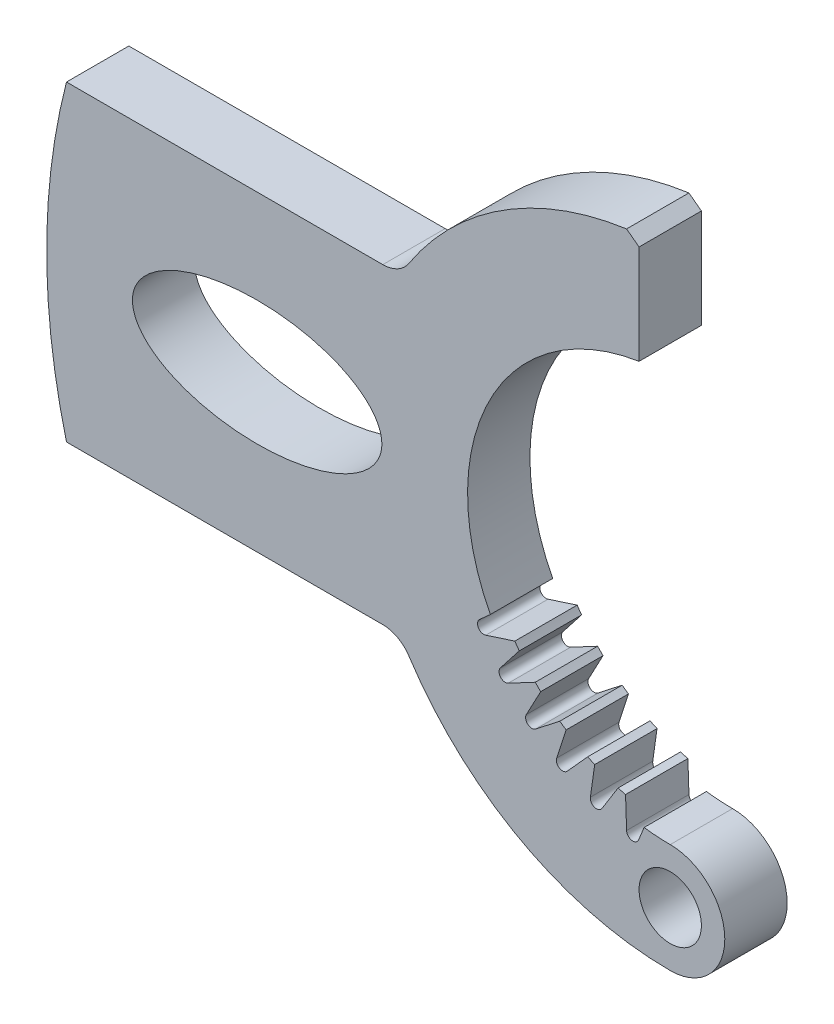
from build123d import *

# Parameters (mm, degrees)
ESQUISSE1_R        = 5
ESQUISSE1_RX       = 20
ESQUISSE1_RY       = 10
BOSS_EXTRU_1_DEPTH = 10


with BuildPart() as part:
    # Esquisse1 → Boss.-Extru.1 (new body)
    with BuildSketch(Plane.XY):
        with BuildLine():
            Line((0, 0), (50.726861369, 0))
            ThreePointArc((50.726861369, 0), (53.110517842, -0.604754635), (54.917563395, -2.272727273))
            ThreePointArc((54.917563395, -2.272727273), (72.988018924, -18.95245365), (96.824583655, -25))
            ThreePointArc((96.824583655, -25), (105.574583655, -16.25), (96.824583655, -7.5))
            ThreePointArc((96.824583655, -7.5), (94.720846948, -7.43184071), (92.625934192, -7.22764873))
            Line((92.625934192, -7.22764873), (91.75521233, -9.382760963))
            ThreePointArc((91.75521233, -9.382760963), (90.654380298, -9.992962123), (89.828637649, -9.043053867))
            Line((89.828637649, -9.043053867), (89.657112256, -4.131209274))
            ThreePointArc((89.657112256, -4.131209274), (89.060012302, -3.977774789), (88.466191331, -3.812102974))
            Line((88.466191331, -3.812102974), (85.861723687, -7.980122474))
            ThreePointArc((85.861723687, -7.980122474), (84.671655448, -8.389895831), (84.023407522, -7.311030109))
            Line((84.023407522, -7.311030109), (84.707420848, -2.4440224))
            ThreePointArc((84.707420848, -2.4440224), (84.146035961, -2.189233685), (83.590005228, -1.922962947))
            Line((83.590005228, -1.922962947), (80.301335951, -5.575399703))
            ThreePointArc((80.301335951, -5.575399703), (79.058191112, -5.772294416), (78.607134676, -4.597251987))
            Line((78.607134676, -4.597251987), (80.12590359, 0.077037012))
            ThreePointArc((80.12590359, 0.077037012), (79.617290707, 0.425438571), (79.115944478, 0.784217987))
            Line((79.115944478, 0.784217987), (75.242998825, -2.241658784))
            ThreePointArc((75.242998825, -2.241658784), (73.98454974, -2.219692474), (73.744389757, -0.984176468))
            Line((73.744389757, -0.984176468), (76.051766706, 3.355368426))
            ThreePointArc((76.051766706, 3.355368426), (75.61138022, 3.786796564), (75.179952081, 4.22718305))
            Line((75.179952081, 4.22718305), (70.840407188, 1.919806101))
            ThreePointArc((70.840407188, 1.919806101), (69.604891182, 2.159966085), (69.582924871, 3.41841517))
            Line((69.582924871, 3.41841517), (72.608801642, 7.291360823))
            ThreePointArc((72.608801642, 7.291360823), (72.250022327, 7.792706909), (71.901620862, 8.301319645))
            Line((71.901620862, 8.301319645), (67.227331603, 6.782551))
            ThreePointArc((67.227331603, 6.782551), (66.052289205, 7.233607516), (66.249184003, 8.476752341))
            Line((66.249184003, 8.476752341), (67.976522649, 10.032055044))
            ThreePointArc((67.976522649, 10.032055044), (67.831850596, 39.685756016), (91.824583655, 57.113081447))
            Line((91.824583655, 57.113081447), (91.824583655, 73))
            Line((91.824583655, 73), (89.824583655, 74.507575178))
            ThreePointArc((89.824583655, 74.507575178), (69.962504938, 67.171420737), (54.917563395, 52.272727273))
            ThreePointArc((54.917563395, 52.272727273), (53.110517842, 50.604754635), (50.726861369, 50))
            Line((50.726861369, 50), (0, 50))
            ThreePointArc((0, 50), (-3.175416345, 25), (0, 0))
        make_face()
        with Locations((96.824583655, -16.25)):
            Circle(ESQUISSE1_R, mode=Mode.SUBTRACT)
        with Locations((30.574583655, 25)):
            Ellipse(ESQUISSE1_RX, ESQUISSE1_RY, mode=Mode.SUBTRACT)
    extrude(amount=BOSS_EXTRU_1_DEPTH)


solid = part.part
